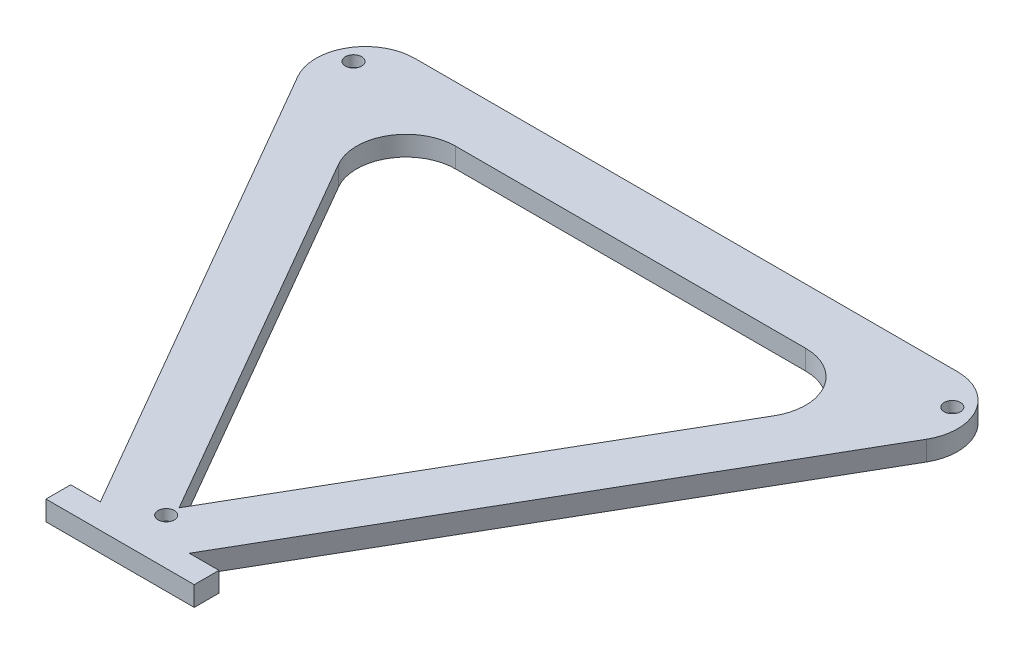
from build123d import *

# Parameters (mm, degrees)
BOSS_EXTRUDE1_DEPTH = 4
SKETCH2_R           = 1.65
CUT_EXTRUDE1_DEPTH  = 2.2


with BuildPart() as part:
    # Sketch1 → Boss-Extrude1 (new body)
    with BuildSketch(Plane(origin=(0, 0, 0), x_dir=(1, 0, 0), z_dir=(0, 1, 0))):
        with BuildLine():
            Line((-50.552239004, -73.99659536), (-105.141984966, 20.555618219))
            ThreePointArc((-105.141984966, 20.555618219), (-106.481730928, 25.555618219), (-105.141984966, 30.555618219))
            ThreePointArc((-105.141984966, 30.555618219), (-101.481730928, 34.215872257), (-96.481730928, 35.555618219))
            Line((-96.481730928, 35.555618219), (13.37725292, 35.555618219))
            ThreePointArc((13.37725292, 35.555618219), (18.37725292, 34.215872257), (22.037506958, 30.555618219))
            ThreePointArc((22.037506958, 30.555618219), (23.37725292, 25.555618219), (22.037506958, 20.555618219))
            Line((22.037506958, 20.555618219), (-32.552239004, -73.99659536))
            Line((-32.552239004, -73.99659536), (-26.552239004, -73.99659536))
            Line((-26.552239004, -73.99659536), (-26.552239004, -78.99659536))
            Line((-26.552239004, -78.99659536), (-36.552239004, -78.99659536))
            Line((-36.552239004, -78.99659536), (-46.552239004, -78.99659536))
            Line((-46.552239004, -78.99659536), (-56.552239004, -78.99659536))
            Line((-56.552239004, -78.99659536), (-56.552239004, -73.99659536))
            Line((-56.552239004, -73.99659536), (-50.552239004, -73.99659536))
        make_face()
        with BuildLine():
            Line((2.537506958, 9.29728797), (-41.552239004, -67.068392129))
            Line((-41.552239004, -67.068392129), (-85.641984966, 9.29728797))
            ThreePointArc((-85.641984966, 9.29728797), (-86.981730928, 14.29728797), (-85.641984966, 19.29728797))
            ThreePointArc((-85.641984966, 19.29728797), (-81.981730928, 22.957542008), (-76.981730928, 24.29728797))
            Line((-76.981730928, 24.29728797), (-6.12274708, 24.29728797))
            ThreePointArc((-6.12274708, 24.29728797), (-1.12274708, 22.957542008), (2.537506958, 19.29728797))
            ThreePointArc((2.537506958, 19.29728797), (3.87725292, 14.29728797), (2.537506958, 9.29728797))
        make_face(mode=Mode.SUBTRACT)
    extrude(amount=BOSS_EXTRUDE1_DEPTH)

    # Sketch2 → Cut-Extrude1 (cut)
    with BuildSketch(Plane(origin=(0, 4, 0), x_dir=(1, 0, 0), z_dir=(0, 1, 0))):
        with Locations(Location((-41.552239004, -69.666468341, 0), (0, 0, 270))):
            Circle(SKETCH2_R)
        with Locations(Location((-102.141984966, 28.823567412, 0), (0, 0, 270))):
            Circle(SKETCH2_R)
        with Locations(Location((19.037506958, 28.823567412, 0), (0, 0, 270))):
            Circle(SKETCH2_R)
    extrude(amount=-CUT_EXTRUDE1_DEPTH, mode=Mode.SUBTRACT)


solid = part.part
